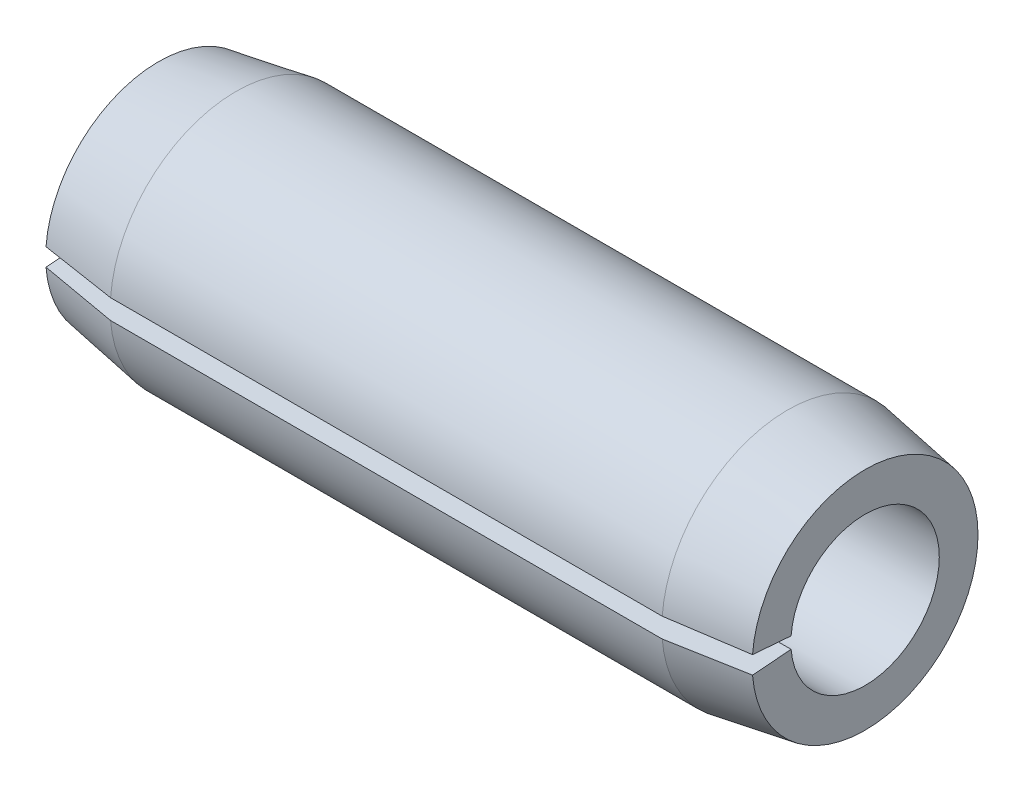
from build123d import *

# Parameters (mm, degrees)
GAP_DEPTH = 12.472592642


with BuildPart() as part:
    # Sketch1 → Base-Revolve (revolve)
    with BuildSketch(Plane.XY, mode=Mode.PRIVATE) as base_revolve_sk:
        Polygon((0, 1.1684), (11.1252, 1.1684), (11.1252, 1.778), (9.906, 1.9812), (1.2192, 1.9812), (0, 1.778), align=None)
    revolve(base_revolve_sk.sketch.rotate(Axis((-9.525, 0, 0), (1, 0, 0)), 90), axis=Axis((-9.525, 0, 0), (1, 0, 0)))

    # Sketch2 → Gap (cut, through all)
    with BuildSketch(Plane(origin=(0, 0, 0), x_dir=(0, -1, 0), z_dir=(-1, 0, 0))):
        with BuildLine():
            Line((0, 0), (0.158552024, 2.014594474))
            ThreePointArc((0.158552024, 2.014594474), (0, 2.020824), (-0.158552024, 2.014594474))
            Line((-0.158552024, 2.014594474), (0, 0))
        make_face()
    extrude(amount=-GAP_DEPTH, mode=Mode.SUBTRACT)


solid = part.part
